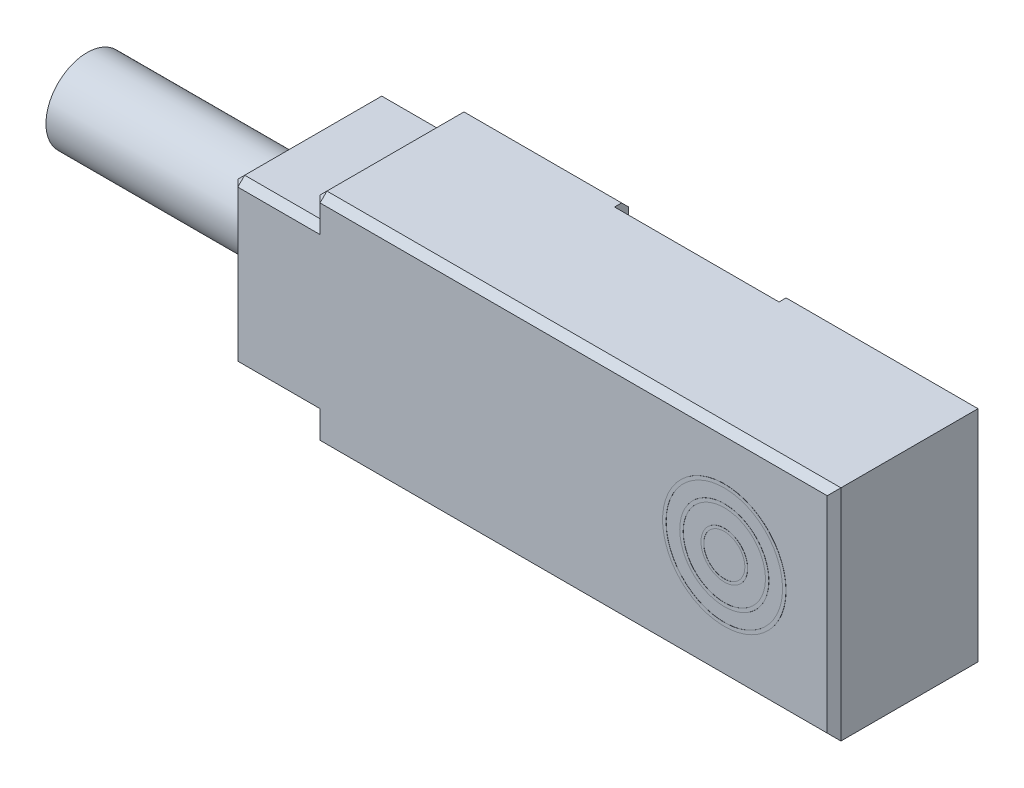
from build123d import *

# Parameters (mm, degrees)
SKETCH1_W           = 22
SKETCH1_H           = 8
BOSS_EXTRUDE1_DEPTH = 5.5
SKETCH2_W           = 3
SKETCH2_H           = 1
CUT_EXTRUDE1_DEPTH  = 16.564382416
SKETCH3_W           = 3
SKETCH3_H           = 1
CUT_EXTRUDE2_DEPTH  = 16.564382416
SKETCH4_W           = 1.5
SKETCH4_H           = 1.5
CUT_EXTRUDE3_DEPTH  = 3
SKETCH5_W           = 6
SKETCH5_H           = 2.5
CUT_EXTRUDE4_DEPTH  = 1.75
SKETCH6_R           = 2.25
BOSS_EXTRUDE2_DEPTH = 0.005
SKETCH7_R           = 2.125
CUT_EXTRUDE5_DEPTH  = 0.005
SKETCH8_R           = 1.625
BOSS_EXTRUDE3_DEPTH = 0.005
SKETCH9_R           = 1.5
CUT_EXTRUDE6_DEPTH  = 0.005
SKETCH10_W          = 8
SKETCH10_H          = 1.5
SKETCH11_W          = 0.85
SKETCH11_H          = 0.005
SKETCH12_W          = 0.75
SKETCH12_H          = 0.005
CHAMFER1_SIZE       = 0.25
SKETCH13_W          = 6
SKETCH13_H          = 6.25
CUT_EXTRUDE7_DEPTH  = 0.508


with BuildPart() as part:
    # Sketch1 → Boss-Extrude1 (new body)
    with BuildSketch(Plane.XY.offset(2.75)):
        with Locations((3, 0)):
            Rectangle(SKETCH1_W, SKETCH1_H)
    extrude(amount=-BOSS_EXTRUDE1_DEPTH)

    # Sketch2 → Cut-Extrude1 (cut, through all)
    with BuildSketch(Plane(origin=(0, 0, -2.75), x_dir=(-1, 0, 0), z_dir=(0, 0, -1))):
        with Locations((6.5, 3.5)):
            Rectangle(SKETCH2_W, SKETCH2_H)
    extrude(amount=-CUT_EXTRUDE1_DEPTH, mode=Mode.SUBTRACT)

    # Sketch3 → Cut-Extrude2 (cut, through all)
    with BuildSketch(Plane(origin=(0, 0, -2.75), x_dir=(-1, 0, 0), z_dir=(0, 0, -1))):
        with Locations((6.5, -3.5)):
            Rectangle(SKETCH3_W, SKETCH3_H)
    extrude(amount=-CUT_EXTRUDE2_DEPTH, mode=Mode.SUBTRACT)

    # Sketch4 → Cut-Extrude3 (cut)
    with BuildSketch(Plane(origin=(0, 0, -2.75), x_dir=(-1, 0, 0), z_dir=(0, 0, -1))):
        with Locations((1.875, -3.25)):
            Rectangle(SKETCH4_W, SKETCH4_H)
    extrude(amount=-CUT_EXTRUDE3_DEPTH, mode=Mode.SUBTRACT)

    # Sketch5 → Cut-Extrude4 (cut)
    with BuildSketch(Plane.XZ.offset(4)):
        with Locations((4, -1.5)):
            Rectangle(SKETCH5_W, SKETCH5_H)
    extrude(amount=-CUT_EXTRUDE4_DEPTH, mode=Mode.SUBTRACT)

    # Sketch6 → Boss-Extrude2 (add)
    with BuildSketch(Plane.XY.offset(2.75)):
        with Locations((10, 0)):
            Circle(SKETCH6_R)
    extrude(amount=BOSS_EXTRUDE2_DEPTH)

    # Sketch7 → Cut-Extrude5 (cut)
    with BuildSketch(Plane.XY.offset(2.755)):
        with Locations(Location((10, 0, 0), (0, 0, 180))):
            Circle(SKETCH7_R)
    extrude(amount=-CUT_EXTRUDE5_DEPTH, mode=Mode.SUBTRACT)

    # Sketch8 → Boss-Extrude3 (add)
    with BuildSketch(Plane.XY.offset(2.75)):
        with Locations(Location((10, 0, 0), (0, 0, 180))):
            Circle(SKETCH8_R)
    extrude(amount=BOSS_EXTRUDE3_DEPTH)

    # Sketch9 → Cut-Extrude6 (cut)
    with BuildSketch(Plane.XY.offset(2.755)):
        with Locations(Location((10, 0, 0), (0, 0, 180))):
            Circle(SKETCH9_R)
    extrude(amount=-CUT_EXTRUDE6_DEPTH, mode=Mode.SUBTRACT)

    # Sketch10 → Revolve1 (revolve)
    with BuildSketch(Plane.XY, mode=Mode.PRIVATE) as revolve1_sk:
        with Locations((-12, 0.75)):
            Rectangle(SKETCH10_W, SKETCH10_H)
    revolve(revolve1_sk.sketch.rotate(Axis((-16, 0, 0), (1, 0, 0)), 270), axis=Axis((-16, 0, 0), (1, 0, 0)))

    # Sketch11 → Revolve2 (revolve)
    with BuildSketch(Plane(origin=(0, 0, 0), x_dir=(1, 0, 0), z_dir=(0, 1, 0))):
        with Locations((10.425, -2.7525)):
            Rectangle(SKETCH11_W, SKETCH11_H)
    revolve(axis=Axis((10, 0, 2.75), (0, 0, 1)))

    # Sketch12 → Cut-Revolve1 (revolve, cut)
    with BuildSketch(Plane(origin=(0, 0, 0), x_dir=(1, 0, 0), z_dir=(0, 1, 0))):
        with Locations((10.375, -2.7525)):
            Rectangle(SKETCH12_W, SKETCH12_H)
    revolve(axis=Axis((10, 0, 2.75), (0, 0, 1)), mode=Mode.SUBTRACT)

    # Chamfer1
    chamfer1_edges = [part.edges().sort_by_distance(p)[0] for p in [
        (-8, 0, 2.75),
        (-8, 0, -2.75),
        (-6.5, 3, 2.75),
        (-8, 3, 0),
        (-5, 3.5, 2.75),
        (-5, 4, 0),
        (-5, 3.5, -2.75),
        (-6.5, 3, -2.75),
        (4.5, -4, 2.75),
        (-3.8125, -4, -2.75),
        (-8, -3, 0),
        (-5, -3.5, 2.75),
        (-5, -4, 0),
        (-6.5, -3, 2.75),
        (-6.5, -3, -2.75),
        (-5, -3.5, -2.75),
        (14, 0, -2.75),
        (-0.0625, -4, -2.75),
        (4.5, 4, 2.75),
        (14, 0, 2.75),
        (10.5, -4, -2.75),
        (4.5, 4, -2.75),
    ]]
    chamfer(chamfer1_edges, length=CHAMFER1_SIZE)

    # Sketch13 → Cut-Extrude7 (cut)
    with BuildSketch(Plane(origin=(0, 0, -2.75), x_dir=(-1, 0, 0), z_dir=(0, 0, -1))):
        with Locations((-4, 0.875)):
            Rectangle(SKETCH13_W, SKETCH13_H)
    extrude(amount=-CUT_EXTRUDE7_DEPTH, mode=Mode.SUBTRACT)


solid = part.part
